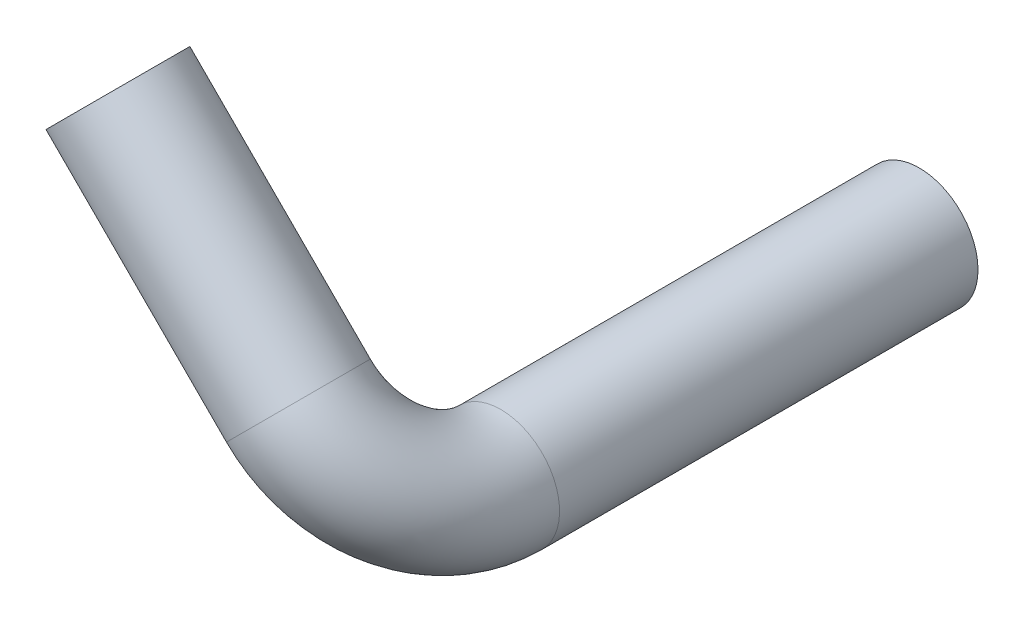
ISO-10303-21;
HEADER;
FILE_DESCRIPTION(('STEP AP214'),'2;1');
FILE_NAME('part.step','',(''),(''),'','','');
FILE_SCHEMA(('AUTOMOTIVE_DESIGN { 1 0 10303 214 1 1 1 1 }'));
ENDSEC;
DATA;
#1=APPLICATION_CONTEXT('core data for automotive mechanical design processes');
#2=APPLICATION_PROTOCOL_DEFINITION('international standard','automotive_design',2000,#1);
#3=PRODUCT_CONTEXT('',#1,'mechanical');
#4=PRODUCT('Part','Part','',(#3));
#5=PRODUCT_RELATED_PRODUCT_CATEGORY('part','',(#4));
#6=PRODUCT_DEFINITION_FORMATION('','',#4);
#7=PRODUCT_DEFINITION_CONTEXT('part definition',#1,'design');
#8=PRODUCT_DEFINITION('design','',#6,#7);
#9=PRODUCT_DEFINITION_SHAPE('','',#8);
#10=(LENGTH_UNIT() NAMED_UNIT(*) SI_UNIT(.MILLI.,.METRE.));
#11=(NAMED_UNIT(*) PLANE_ANGLE_UNIT() SI_UNIT($,.RADIAN.));
#12=(NAMED_UNIT(*) SI_UNIT($,.STERADIAN.) SOLID_ANGLE_UNIT());
#13=UNCERTAINTY_MEASURE_WITH_UNIT(LENGTH_MEASURE(1.E-05),#10,'distance_accuracy_value','');
#14=(GEOMETRIC_REPRESENTATION_CONTEXT(3) GLOBAL_UNCERTAINTY_ASSIGNED_CONTEXT((#13)) GLOBAL_UNIT_ASSIGNED_CONTEXT((#10,
#11,#12)) REPRESENTATION_CONTEXT('',''));
#15=CARTESIAN_POINT('',(0.,0.,0.));
#16=DIRECTION('',(0.,0.,1.));
#17=DIRECTION('',(1.,0.,0.));
#18=AXIS2_PLACEMENT_3D('',#15,#16,#17);
#19=CARTESIAN_POINT('',(0.,0.,0.));
#20=DIRECTION('',(0.,0.,1.));
#21=DIRECTION('',(1.,0.,0.));
#22=AXIS2_PLACEMENT_3D('',#19,#20,#21);
#23=PLANE('',#22);
#24=CARTESIAN_POINT('',(0.,0.,0.));
#25=DIRECTION('',(0.,0.,1.));
#26=DIRECTION('',(1.,0.,0.));
#27=AXIS2_PLACEMENT_3D('',#24,#25,#26);
#28=CIRCLE('',#27,30.226);
#29=CARTESIAN_POINT('',(30.226,0.,0.));
#30=VERTEX_POINT('',#29);
#31=EDGE_CURVE('E33',#30,#30,#28,.T.);
#32=ORIENTED_EDGE('',*,*,#31,.F.);
#33=EDGE_LOOP('',(#32));
#34=FACE_BOUND('',#33,.T.);
#35=CARTESIAN_POINT('',(0.,0.,0.));
#36=DIRECTION('',(0.,0.,1.));
#37=DIRECTION('',(1.,0.,0.));
#38=AXIS2_PLACEMENT_3D('',#35,#36,#37);
#39=CIRCLE('',#38,26.3144);
#40=CARTESIAN_POINT('',(26.3144,0.,0.));
#41=VERTEX_POINT('',#40);
#42=EDGE_CURVE('E40',#41,#41,#39,.T.);
#43=ORIENTED_EDGE('',*,*,#42,.T.);
#44=EDGE_LOOP('',(#43));
#45=FACE_BOUND('',#44,.T.);
#46=ADVANCED_FACE('F29',(#34,#45),#23,.F.);
#47=CARTESIAN_POINT('',(0.,0.,215.21525641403));
#48=DIRECTION('',(0.,0.,-1.));
#49=DIRECTION('',(-1.,0.,0.));
#50=AXIS2_PLACEMENT_3D('',#47,#48,#49);
#51=CYLINDRICAL_SURFACE('',#50,30.226);
#52=CARTESIAN_POINT('',(0.,0.,215.21525641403));
#53=DIRECTION('',(0.,0.,1.));
#54=DIRECTION('',(1.,0.,0.));
#55=AXIS2_PLACEMENT_3D('',#52,#53,#54);
#56=CIRCLE('',#55,30.226);
#57=CARTESIAN_POINT('',(21.3730095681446,-21.3730095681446,215.21525641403));
#58=VERTEX_POINT('',#57);
#59=EDGE_CURVE('E10',#58,#58,#56,.T.);
#60=ORIENTED_EDGE('',*,*,#59,.F.);
#61=EDGE_LOOP('',(#60));
#62=FACE_BOUND('',#61,.T.);
#63=ORIENTED_EDGE('',*,*,#31,.T.);
#64=EDGE_LOOP('',(#63));
#65=FACE_BOUND('',#64,.T.);
#66=ADVANCED_FACE('F31',(#62,#65),#51,.T.);
#67=CARTESIAN_POINT('',(0.,0.,215.21525641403));
#68=DIRECTION('',(0.,0.,-1.));
#69=DIRECTION('',(-1.,0.,0.));
#70=AXIS2_PLACEMENT_3D('',#67,#68,#69);
#71=CYLINDRICAL_SURFACE('',#70,26.3144);
#72=CARTESIAN_POINT('',(0.,0.,215.21525641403));
#73=DIRECTION('',(0.,0.,1.));
#74=DIRECTION('',(1.,0.,0.));
#75=AXIS2_PLACEMENT_3D('',#72,#73,#74);
#76=CIRCLE('',#75,26.3144);
#77=CARTESIAN_POINT('',(18.6070906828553,-18.6070906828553,215.21525641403));
#78=VERTEX_POINT('',#77);
#79=EDGE_CURVE('E47',#78,#78,#76,.T.);
#80=ORIENTED_EDGE('',*,*,#79,.T.);
#81=EDGE_LOOP('',(#80));
#82=FACE_BOUND('',#81,.T.);
#83=ORIENTED_EDGE('',*,*,#42,.F.);
#84=EDGE_LOOP('',(#83));
#85=FACE_BOUND('',#84,.T.);
#86=ADVANCED_FACE('F84',(#82,#85),#71,.F.);
#87=CARTESIAN_POINT('',(-43.1052293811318,43.1052293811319,215.21525641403));
#88=DIRECTION('',(0.707106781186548,0.707106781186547,0.));
#89=DIRECTION('',(-0.707106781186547,0.707106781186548,0.));
#90=AXIS2_PLACEMENT_3D('',#87,#88,#89);
#91=TOROIDAL_SURFACE('',#90,60.9599999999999,26.3144);
#92=CARTESIAN_POINT('',(-43.1052293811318,43.105229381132,276.17525641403));
#93=DIRECTION('',(-0.707106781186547,0.707106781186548,0.));
#94=DIRECTION('',(-0.707106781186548,-0.707106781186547,0.));
#95=AXIS2_PLACEMENT_3D('',#92,#93,#94);
#96=CIRCLE('',#95,26.3144);
#97=CARTESIAN_POINT('',(-43.1052293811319,43.105229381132,302.48965641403));
#98=VERTEX_POINT('',#97);
#99=EDGE_CURVE('E54',#98,#98,#96,.T.);
#100=CARTESIAN_POINT('',(-43.1052293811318,43.1052293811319,215.21525641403));
#101=DIRECTION('',(0.707106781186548,0.707106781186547,0.));
#102=DIRECTION('',(-0.707106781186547,0.707106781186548,0.));
#103=AXIS2_PLACEMENT_3D('',#100,#101,#102);
#104=CIRCLE('',#103,87.2743999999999);
#105=EDGE_CURVE('',#98,#78,#104,.T.);
#106=ORIENTED_EDGE('',*,*,#99,.T.);
#107=ORIENTED_EDGE('',*,*,#79,.F.);
#108=ORIENTED_EDGE('',*,*,#105,.T.);
#109=ORIENTED_EDGE('',*,*,#105,.F.);
#110=EDGE_LOOP('',(#106,#108,#107,#109));
#111=FACE_BOUND('',#110,.T.);
#112=ADVANCED_FACE('F75',(#111),#91,.F.);
#113=CARTESIAN_POINT('',(-43.1052293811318,43.1052293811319,215.21525641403));
#114=DIRECTION('',(0.707106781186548,0.707106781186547,0.));
#115=DIRECTION('',(-0.707106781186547,0.707106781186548,0.));
#116=AXIS2_PLACEMENT_3D('',#113,#114,#115);
#117=TOROIDAL_SURFACE('',#116,60.9599999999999,30.226);
#118=CARTESIAN_POINT('',(-43.1052293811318,43.105229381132,276.17525641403));
#119=DIRECTION('',(-0.707106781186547,0.707106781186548,0.));
#120=DIRECTION('',(0.500000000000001,0.5,0.707106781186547));
#121=AXIS2_PLACEMENT_3D('',#118,#119,#120);
#122=CIRCLE('',#121,30.226);
#123=CARTESIAN_POINT('',(-43.1052293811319,43.105229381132,306.40125641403));
#124=VERTEX_POINT('',#123);
#125=EDGE_CURVE('E44',#124,#124,#122,.T.);
#126=CARTESIAN_POINT('',(-43.1052293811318,43.1052293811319,215.21525641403));
#127=DIRECTION('',(0.707106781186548,0.707106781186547,0.));
#128=DIRECTION('',(-0.707106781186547,0.707106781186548,0.));
#129=AXIS2_PLACEMENT_3D('',#126,#127,#128);
#130=CIRCLE('',#129,91.1859999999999);
#131=EDGE_CURVE('',#124,#58,#130,.T.);
#132=ORIENTED_EDGE('',*,*,#125,.F.);
#133=ORIENTED_EDGE('',*,*,#59,.T.);
#134=ORIENTED_EDGE('',*,*,#131,.T.);
#135=ORIENTED_EDGE('',*,*,#131,.F.);
#136=EDGE_LOOP('',(#132,#134,#133,#135));
#137=FACE_BOUND('',#136,.T.);
#138=ADVANCED_FACE('F66',(#137),#117,.T.);
#139=CARTESIAN_POINT('',(-135.931096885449,135.93109688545,276.17525641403));
#140=DIRECTION('',(-0.707106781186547,0.707106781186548,0.));
#141=DIRECTION('',(-0.707106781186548,-0.707106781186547,0.));
#142=AXIS2_PLACEMENT_3D('',#139,#140,#141);
#143=PLANE('',#142);
#144=CARTESIAN_POINT('',(-135.931096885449,135.93109688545,276.17525641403));
#145=DIRECTION('',(-0.707106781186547,0.707106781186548,0.));
#146=DIRECTION('',(-0.707106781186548,-0.707106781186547,0.));
#147=AXIS2_PLACEMENT_3D('',#144,#145,#146);
#148=CIRCLE('',#147,30.226);
#149=CARTESIAN_POINT('',(-157.304106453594,114.558087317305,276.17525641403));
#150=VERTEX_POINT('',#149);
#151=EDGE_CURVE('E50',#150,#150,#148,.T.);
#152=ORIENTED_EDGE('',*,*,#151,.T.);
#153=EDGE_LOOP('',(#152));
#154=FACE_BOUND('',#153,.T.);
#155=CARTESIAN_POINT('',(-135.931096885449,135.93109688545,276.17525641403));
#156=DIRECTION('',(-0.707106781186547,0.707106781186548,0.));
#157=DIRECTION('',(-0.707106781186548,-0.707106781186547,0.));
#158=AXIS2_PLACEMENT_3D('',#155,#156,#157);
#159=CIRCLE('',#158,26.3144);
#160=CARTESIAN_POINT('',(-154.538187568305,117.324006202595,276.17525641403));
#161=VERTEX_POINT('',#160);
#162=EDGE_CURVE('E53',#161,#161,#159,.T.);
#163=ORIENTED_EDGE('',*,*,#162,.F.);
#164=EDGE_LOOP('',(#163));
#165=FACE_BOUND('',#164,.T.);
#166=ADVANCED_FACE('F63',(#154,#165),#143,.T.);
#167=CARTESIAN_POINT('',(-135.931096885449,135.93109688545,276.17525641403));
#168=DIRECTION('',(0.707106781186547,-0.707106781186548,0.));
#169=DIRECTION('',(0.707106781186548,0.707106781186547,0.));
#170=AXIS2_PLACEMENT_3D('',#167,#168,#169);
#171=CYLINDRICAL_SURFACE('',#170,30.226);
#172=ORIENTED_EDGE('',*,*,#151,.F.);
#173=EDGE_LOOP('',(#172));
#174=FACE_BOUND('',#173,.T.);
#175=ORIENTED_EDGE('',*,*,#125,.T.);
#176=EDGE_LOOP('',(#175));
#177=FACE_BOUND('',#176,.T.);
#178=ADVANCED_FACE('F65',(#174,#177),#171,.T.);
#179=CARTESIAN_POINT('',(-135.931096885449,135.93109688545,276.17525641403));
#180=DIRECTION('',(0.707106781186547,-0.707106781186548,0.));
#181=DIRECTION('',(0.707106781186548,0.707106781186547,0.));
#182=AXIS2_PLACEMENT_3D('',#179,#180,#181);
#183=CYLINDRICAL_SURFACE('',#182,26.3144);
#184=ORIENTED_EDGE('',*,*,#162,.T.);
#185=EDGE_LOOP('',(#184));
#186=FACE_BOUND('',#185,.T.);
#187=ORIENTED_EDGE('',*,*,#99,.F.);
#188=EDGE_LOOP('',(#187));
#189=FACE_BOUND('',#188,.T.);
#190=ADVANCED_FACE('F60',(#186,#189),#183,.F.);
#191=CLOSED_SHELL('',(#46,#66,#86,#112,#138,#166,#178,#190));
#192=MANIFOLD_SOLID_BREP('B2',#191);
#193=ADVANCED_BREP_SHAPE_REPRESENTATION('',(#18,#192),#14);
#194=SHAPE_DEFINITION_REPRESENTATION(#9,#193);
ENDSEC;
END-ISO-10303-21;
